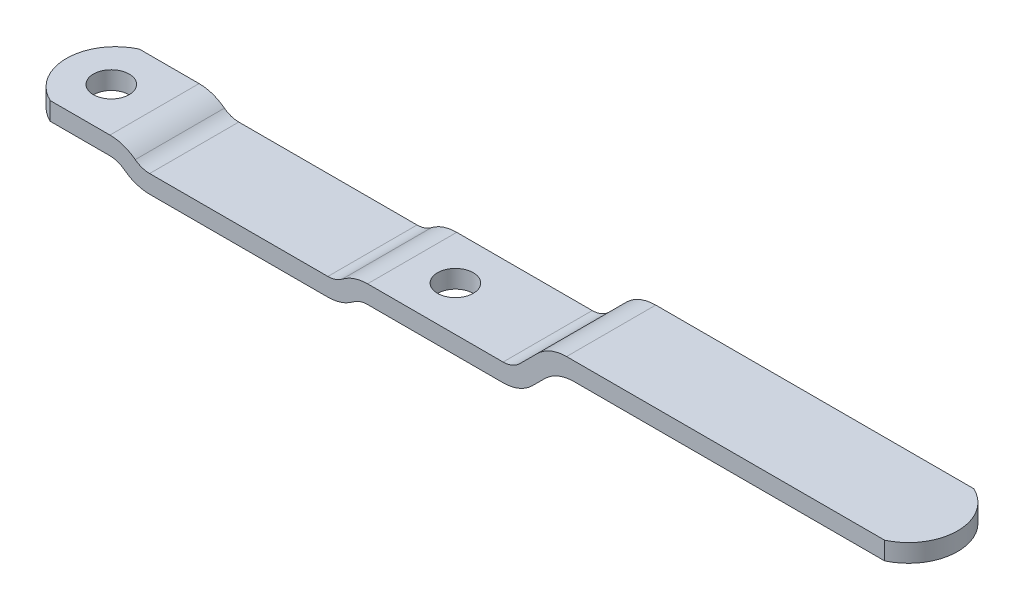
ISO-10303-21;
HEADER;
FILE_DESCRIPTION(('STEP AP214'),'2;1');
FILE_NAME('part.step','',(''),(''),'','','');
FILE_SCHEMA(('AUTOMOTIVE_DESIGN { 1 0 10303 214 1 1 1 1 }'));
ENDSEC;
DATA;
#1=APPLICATION_CONTEXT('core data for automotive mechanical design processes');
#2=APPLICATION_PROTOCOL_DEFINITION('international standard','automotive_design',2000,#1);
#3=PRODUCT_CONTEXT('',#1,'mechanical');
#4=PRODUCT('Part','Part','',(#3));
#5=PRODUCT_RELATED_PRODUCT_CATEGORY('part','',(#4));
#6=PRODUCT_DEFINITION_FORMATION('','',#4);
#7=PRODUCT_DEFINITION_CONTEXT('part definition',#1,'design');
#8=PRODUCT_DEFINITION('design','',#6,#7);
#9=PRODUCT_DEFINITION_SHAPE('','',#8);
#10=(LENGTH_UNIT() NAMED_UNIT(*) SI_UNIT(.MILLI.,.METRE.));
#11=(NAMED_UNIT(*) PLANE_ANGLE_UNIT() SI_UNIT($,.RADIAN.));
#12=(NAMED_UNIT(*) SI_UNIT($,.STERADIAN.) SOLID_ANGLE_UNIT());
#13=UNCERTAINTY_MEASURE_WITH_UNIT(LENGTH_MEASURE(1.E-05),#10,'distance_accuracy_value','');
#14=(GEOMETRIC_REPRESENTATION_CONTEXT(3) GLOBAL_UNCERTAINTY_ASSIGNED_CONTEXT((#13)) GLOBAL_UNIT_ASSIGNED_CONTEXT((#10,
#11,#12)) REPRESENTATION_CONTEXT('',''));
#15=CARTESIAN_POINT('',(0.,0.,0.));
#16=DIRECTION('',(0.,0.,1.));
#17=DIRECTION('',(1.,0.,0.));
#18=AXIS2_PLACEMENT_3D('',#15,#16,#17);
#19=CARTESIAN_POINT('',(265.455705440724,45.4280750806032,7.9375));
#20=DIRECTION('',(0.,-1.,0.));
#21=DIRECTION('',(1.,0.,0.));
#22=AXIS2_PLACEMENT_3D('',#19,#20,#21);
#23=CYLINDRICAL_SURFACE('',#22,3.1875);
#24=CARTESIAN_POINT('',(265.455705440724,205.378428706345,7.9375));
#25=DIRECTION('',(0.,-1.,0.));
#26=DIRECTION('',(1.,0.,0.));
#27=AXIS2_PLACEMENT_3D('',#24,#25,#26);
#28=CIRCLE('',#27,3.1875);
#29=CARTESIAN_POINT('',(268.643205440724,205.378428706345,7.9375));
#30=VERTEX_POINT('',#29);
#31=EDGE_CURVE('E246',#30,#30,#28,.T.);
#32=ORIENTED_EDGE('',*,*,#31,.F.);
#33=EDGE_LOOP('',(#32));
#34=FACE_BOUND('',#33,.T.);
#35=CARTESIAN_POINT('',(265.455705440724,202.178428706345,7.9375));
#36=DIRECTION('',(0.,-1.,0.));
#37=DIRECTION('',(1.,0.,0.));
#38=AXIS2_PLACEMENT_3D('',#35,#36,#37);
#39=CIRCLE('',#38,3.1875);
#40=CARTESIAN_POINT('',(268.643205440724,202.178428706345,7.9375));
#41=VERTEX_POINT('',#40);
#42=EDGE_CURVE('E242',#41,#41,#39,.F.);
#43=ORIENTED_EDGE('',*,*,#42,.F.);
#44=EDGE_LOOP('',(#43));
#45=FACE_BOUND('',#44,.T.);
#46=ADVANCED_FACE('F15',(#34,#45),#23,.F.);
#47=CARTESIAN_POINT('',(326.725705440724,45.4280750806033,7.9375));
#48=DIRECTION('',(0.,-1.,0.));
#49=DIRECTION('',(0.,0.,-1.));
#50=AXIS2_PLACEMENT_3D('',#47,#48,#49);
#51=CYLINDRICAL_SURFACE('',#50,3.1875);
#52=CARTESIAN_POINT('',(326.725705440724,205.378428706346,7.9375));
#53=DIRECTION('',(0.,-1.,0.));
#54=DIRECTION('',(0.,0.,-1.));
#55=AXIS2_PLACEMENT_3D('',#52,#53,#54);
#56=CIRCLE('',#55,3.1875);
#57=CARTESIAN_POINT('',(326.725705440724,205.378428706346,4.75));
#58=VERTEX_POINT('',#57);
#59=EDGE_CURVE('E18',#58,#58,#56,.T.);
#60=ORIENTED_EDGE('',*,*,#59,.F.);
#61=EDGE_LOOP('',(#60));
#62=FACE_BOUND('',#61,.T.);
#63=CARTESIAN_POINT('',(326.725705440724,202.178428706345,7.9375));
#64=DIRECTION('',(0.,-1.,0.));
#65=DIRECTION('',(0.,0.,-1.));
#66=AXIS2_PLACEMENT_3D('',#63,#64,#65);
#67=CIRCLE('',#66,3.1875);
#68=CARTESIAN_POINT('',(326.725705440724,202.178428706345,4.75));
#69=VERTEX_POINT('',#68);
#70=EDGE_CURVE('E237',#69,#69,#67,.F.);
#71=ORIENTED_EDGE('',*,*,#70,.F.);
#72=EDGE_LOOP('',(#71));
#73=FACE_BOUND('',#72,.T.);
#74=ADVANCED_FACE('F283',(#62,#73),#51,.F.);
#75=CARTESIAN_POINT('',(346.125553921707,206.608580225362,0.));
#76=DIRECTION('',(-0.707106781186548,0.707106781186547,0.));
#77=DIRECTION('',(-0.707106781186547,-0.707106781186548,0.));
#78=AXIS2_PLACEMENT_3D('',#75,#76,#77);
#79=PLANE('',#78);
#80=DIRECTION('',(-0.707106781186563,-0.707106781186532,0.));
#81=VECTOR('',#80,1.);
#82=CARTESIAN_POINT('',(349.227992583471,209.711018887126,0.));
#83=LINE('',#82,#81);
#84=CARTESIAN_POINT('',(349.227992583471,209.711018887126,0.));
#85=VERTEX_POINT('',#84);
#86=CARTESIAN_POINT('',(346.125553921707,206.608580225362,0.));
#87=VERTEX_POINT('',#86);
#88=EDGE_CURVE('E233',#85,#87,#83,.T.);
#89=ORIENTED_EDGE('',*,*,#88,.T.);
#90=DIRECTION('',(0.,0.,1.));
#91=VECTOR('',#90,1.);
#92=CARTESIAN_POINT('',(346.125553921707,206.608580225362,0.));
#93=LINE('',#92,#91);
#94=CARTESIAN_POINT('',(346.125553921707,206.608580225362,15.875));
#95=VERTEX_POINT('',#94);
#96=EDGE_CURVE('E272',#95,#87,#93,.F.);
#97=ORIENTED_EDGE('',*,*,#96,.F.);
#98=DIRECTION('',(-0.707106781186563,-0.707106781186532,0.));
#99=VECTOR('',#98,1.);
#100=CARTESIAN_POINT('',(349.227992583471,209.711018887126,15.875));
#101=LINE('',#100,#99);
#102=CARTESIAN_POINT('',(349.227992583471,209.711018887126,15.875));
#103=VERTEX_POINT('',#102);
#104=EDGE_CURVE('E200',#103,#95,#101,.T.);
#105=ORIENTED_EDGE('',*,*,#104,.F.);
#106=DIRECTION('',(0.,0.,1.));
#107=VECTOR('',#106,1.);
#108=CARTESIAN_POINT('',(349.227992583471,209.711018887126,0.));
#109=LINE('',#108,#107);
#110=EDGE_CURVE('E153',#85,#103,#109,.T.);
#111=ORIENTED_EDGE('',*,*,#110,.F.);
#112=EDGE_LOOP('',(#89,#97,#105,#111));
#113=FACE_BOUND('',#112,.T.);
#114=ADVANCED_FACE('F286',(#113),#79,.T.);
#115=CARTESIAN_POINT('',(343.155705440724,209.578428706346,0.));
#116=DIRECTION('',(0.,0.,1.));
#117=DIRECTION('',(1.,0.,0.));
#118=AXIS2_PLACEMENT_3D('',#115,#116,#117);
#119=CYLINDRICAL_SURFACE('',#118,4.19999999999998);
#120=CARTESIAN_POINT('',(343.155705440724,209.578428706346,0.));
#121=DIRECTION('',(0.,0.,1.));
#122=DIRECTION('',(1.,0.,0.));
#123=AXIS2_PLACEMENT_3D('',#120,#121,#122);
#124=CIRCLE('',#123,4.19999999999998);
#125=CARTESIAN_POINT('',(343.155705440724,205.378428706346,0.));
#126=VERTEX_POINT('',#125);
#127=EDGE_CURVE('E231',#87,#126,#124,.F.);
#128=ORIENTED_EDGE('',*,*,#127,.T.);
#129=DIRECTION('',(0.,0.,1.));
#130=VECTOR('',#129,1.);
#131=CARTESIAN_POINT('',(343.155705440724,205.378428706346,0.));
#132=LINE('',#131,#130);
#133=CARTESIAN_POINT('',(343.155705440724,205.378428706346,15.875));
#134=VERTEX_POINT('',#133);
#135=EDGE_CURVE('E270',#134,#126,#132,.F.);
#136=ORIENTED_EDGE('',*,*,#135,.F.);
#137=CARTESIAN_POINT('',(343.155705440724,209.578428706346,15.875));
#138=DIRECTION('',(0.,0.,1.));
#139=DIRECTION('',(1.,0.,0.));
#140=AXIS2_PLACEMENT_3D('',#137,#138,#139);
#141=CIRCLE('',#140,4.19999999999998);
#142=EDGE_CURVE('E197',#95,#134,#141,.F.);
#143=ORIENTED_EDGE('',*,*,#142,.F.);
#144=ORIENTED_EDGE('',*,*,#96,.T.);
#145=EDGE_LOOP('',(#128,#136,#143,#144));
#146=FACE_BOUND('',#145,.T.);
#147=ADVANCED_FACE('F447',(#146),#119,.F.);
#148=CARTESIAN_POINT('',(319.025705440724,205.378428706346,0.));
#149=DIRECTION('',(0.,1.,0.));
#150=DIRECTION('',(0.,0.,1.));
#151=AXIS2_PLACEMENT_3D('',#148,#149,#150);
#152=PLANE('',#151);
#153=DIRECTION('',(1.,0.,0.));
#154=VECTOR('',#153,1.);
#155=CARTESIAN_POINT('',(336.697336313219,205.378428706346,0.));
#156=LINE('',#155,#154);
#157=CARTESIAN_POINT('',(319.025705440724,205.378428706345,0.));
#158=VERTEX_POINT('',#157);
#159=EDGE_CURVE('E230',#126,#158,#156,.F.);
#160=ORIENTED_EDGE('',*,*,#159,.T.);
#161=DIRECTION('',(0.,0.,1.));
#162=VECTOR('',#161,1.);
#163=CARTESIAN_POINT('',(319.025705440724,205.378428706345,0.));
#164=LINE('',#163,#162);
#165=CARTESIAN_POINT('',(319.025705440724,205.378428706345,15.875));
#166=VERTEX_POINT('',#165);
#167=EDGE_CURVE('E267',#166,#158,#164,.F.);
#168=ORIENTED_EDGE('',*,*,#167,.F.);
#169=DIRECTION('',(1.,0.,0.));
#170=VECTOR('',#169,1.);
#171=CARTESIAN_POINT('',(336.697336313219,205.378428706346,15.875));
#172=LINE('',#171,#170);
#173=EDGE_CURVE('E196',#134,#166,#172,.F.);
#174=ORIENTED_EDGE('',*,*,#173,.F.);
#175=ORIENTED_EDGE('',*,*,#135,.T.);
#176=EDGE_LOOP('',(#160,#168,#174,#175));
#177=FACE_BOUND('',#176,.T.);
#178=ORIENTED_EDGE('',*,*,#59,.T.);
#179=EDGE_LOOP('',(#178));
#180=FACE_BOUND('',#179,.T.);
#181=ADVANCED_FACE('F281',(#177,#180),#152,.T.);
#182=CARTESIAN_POINT('',(319.025705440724,197.978428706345,0.));
#183=DIRECTION('',(0.,0.,1.));
#184=DIRECTION('',(1.,0.,0.));
#185=AXIS2_PLACEMENT_3D('',#182,#183,#184);
#186=CYLINDRICAL_SURFACE('',#185,7.4);
#187=CARTESIAN_POINT('',(319.025705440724,197.978428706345,0.));
#188=DIRECTION('',(0.,0.,1.));
#189=DIRECTION('',(1.,0.,0.));
#190=AXIS2_PLACEMENT_3D('',#187,#188,#189);
#191=CIRCLE('',#190,7.4);
#192=CARTESIAN_POINT('',(314.518461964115,203.847394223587,0.));
#193=VERTEX_POINT('',#192);
#194=EDGE_CURVE('E228',#158,#193,#191,.T.);
#195=ORIENTED_EDGE('',*,*,#194,.T.);
#196=DIRECTION('',(0.,0.,1.));
#197=VECTOR('',#196,1.);
#198=CARTESIAN_POINT('',(314.518461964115,203.847394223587,0.));
#199=LINE('',#198,#197);
#200=CARTESIAN_POINT('',(314.518461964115,203.847394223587,15.875));
#201=VERTEX_POINT('',#200);
#202=EDGE_CURVE('E264',#201,#193,#199,.F.);
#203=ORIENTED_EDGE('',*,*,#202,.F.);
#204=CARTESIAN_POINT('',(319.025705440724,197.978428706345,15.875));
#205=DIRECTION('',(0.,0.,1.));
#206=DIRECTION('',(1.,0.,0.));
#207=AXIS2_PLACEMENT_3D('',#204,#205,#206);
#208=CIRCLE('',#207,7.4);
#209=EDGE_CURVE('E193',#166,#201,#208,.T.);
#210=ORIENTED_EDGE('',*,*,#209,.F.);
#211=ORIENTED_EDGE('',*,*,#167,.T.);
#212=EDGE_LOOP('',(#195,#203,#210,#211));
#213=FACE_BOUND('',#212,.T.);
#214=ADVANCED_FACE('F455',(#213),#186,.T.);
#215=CARTESIAN_POINT('',(311.960296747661,207.178428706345,0.));
#216=DIRECTION('',(0.,0.,1.));
#217=DIRECTION('',(1.,0.,0.));
#218=AXIS2_PLACEMENT_3D('',#215,#216,#217);
#219=CYLINDRICAL_SURFACE('',#218,4.19999999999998);
#220=CARTESIAN_POINT('',(311.960296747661,207.178428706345,0.));
#221=DIRECTION('',(0.,0.,1.));
#222=DIRECTION('',(1.,0.,0.));
#223=AXIS2_PLACEMENT_3D('',#220,#221,#222);
#224=CIRCLE('',#223,4.19999999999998);
#225=CARTESIAN_POINT('',(311.960296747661,202.978428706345,0.));
#226=VERTEX_POINT('',#225);
#227=EDGE_CURVE('E226',#193,#226,#224,.F.);
#228=ORIENTED_EDGE('',*,*,#227,.T.);
#229=DIRECTION('',(0.,0.,1.));
#230=VECTOR('',#229,1.);
#231=CARTESIAN_POINT('',(311.960296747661,202.978428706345,0.));
#232=LINE('',#231,#230);
#233=CARTESIAN_POINT('',(311.960296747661,202.978428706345,15.875));
#234=VERTEX_POINT('',#233);
#235=EDGE_CURVE('E258',#234,#226,#232,.F.);
#236=ORIENTED_EDGE('',*,*,#235,.F.);
#237=CARTESIAN_POINT('',(311.960296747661,207.178428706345,15.875));
#238=DIRECTION('',(0.,0.,1.));
#239=DIRECTION('',(1.,0.,0.));
#240=AXIS2_PLACEMENT_3D('',#237,#238,#239);
#241=CIRCLE('',#240,4.19999999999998);
#242=EDGE_CURVE('E190',#201,#234,#241,.F.);
#243=ORIENTED_EDGE('',*,*,#242,.F.);
#244=ORIENTED_EDGE('',*,*,#202,.T.);
#245=EDGE_LOOP('',(#228,#236,#243,#244));
#246=FACE_BOUND('',#245,.T.);
#247=ADVANCED_FACE('F459',(#246),#219,.F.);
#248=CARTESIAN_POINT('',(280.221114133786,202.978428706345,0.));
#249=DIRECTION('',(0.,1.,0.));
#250=DIRECTION('',(0.,0.,1.));
#251=AXIS2_PLACEMENT_3D('',#248,#249,#250);
#252=PLANE('',#251);
#253=DIRECTION('',(1.,0.,0.));
#254=VECTOR('',#253,1.);
#255=CARTESIAN_POINT('',(336.697336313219,202.978428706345,0.));
#256=LINE('',#255,#254);
#257=CARTESIAN_POINT('',(280.221114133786,202.978428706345,0.));
#258=VERTEX_POINT('',#257);
#259=EDGE_CURVE('E225',#226,#258,#256,.F.);
#260=ORIENTED_EDGE('',*,*,#259,.T.);
#261=DIRECTION('',(0.,0.,1.));
#262=VECTOR('',#261,1.);
#263=CARTESIAN_POINT('',(280.221114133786,202.978428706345,0.));
#264=LINE('',#263,#262);
#265=CARTESIAN_POINT('',(280.221114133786,202.978428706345,15.875));
#266=VERTEX_POINT('',#265);
#267=EDGE_CURVE('E252',#266,#258,#264,.F.);
#268=ORIENTED_EDGE('',*,*,#267,.F.);
#269=DIRECTION('',(1.,0.,0.));
#270=VECTOR('',#269,1.);
#271=CARTESIAN_POINT('',(336.697336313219,202.978428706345,15.875));
#272=LINE('',#271,#270);
#273=EDGE_CURVE('E189',#234,#266,#272,.F.);
#274=ORIENTED_EDGE('',*,*,#273,.F.);
#275=ORIENTED_EDGE('',*,*,#235,.T.);
#276=EDGE_LOOP('',(#260,#268,#274,#275));
#277=FACE_BOUND('',#276,.T.);
#278=ADVANCED_FACE('F462',(#277),#252,.T.);
#279=CARTESIAN_POINT('',(280.221114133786,207.178428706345,0.));
#280=DIRECTION('',(0.,0.,1.));
#281=DIRECTION('',(1.,0.,0.));
#282=AXIS2_PLACEMENT_3D('',#279,#280,#281);
#283=CYLINDRICAL_SURFACE('',#282,4.19999999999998);
#284=CARTESIAN_POINT('',(280.221114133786,207.178428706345,0.));
#285=DIRECTION('',(0.,0.,1.));
#286=DIRECTION('',(1.,0.,0.));
#287=AXIS2_PLACEMENT_3D('',#284,#285,#286);
#288=CIRCLE('',#287,4.19999999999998);
#289=CARTESIAN_POINT('',(277.662948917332,203.847394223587,0.));
#290=VERTEX_POINT('',#289);
#291=EDGE_CURVE('E223',#258,#290,#288,.F.);
#292=ORIENTED_EDGE('',*,*,#291,.T.);
#293=DIRECTION('',(0.,0.,1.));
#294=VECTOR('',#293,1.);
#295=CARTESIAN_POINT('',(277.662948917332,203.847394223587,0.));
#296=LINE('',#295,#294);
#297=CARTESIAN_POINT('',(277.662948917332,203.847394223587,15.875));
#298=VERTEX_POINT('',#297);
#299=EDGE_CURVE('E248',#298,#290,#296,.F.);
#300=ORIENTED_EDGE('',*,*,#299,.F.);
#301=CARTESIAN_POINT('',(280.221114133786,207.178428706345,15.875));
#302=DIRECTION('',(0.,0.,1.));
#303=DIRECTION('',(1.,0.,0.));
#304=AXIS2_PLACEMENT_3D('',#301,#302,#303);
#305=CIRCLE('',#304,4.19999999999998);
#306=EDGE_CURVE('E186',#266,#298,#305,.F.);
#307=ORIENTED_EDGE('',*,*,#306,.F.);
#308=ORIENTED_EDGE('',*,*,#267,.T.);
#309=EDGE_LOOP('',(#292,#300,#307,#308));
#310=FACE_BOUND('',#309,.T.);
#311=ADVANCED_FACE('F466',(#310),#283,.F.);
#312=CARTESIAN_POINT('',(273.155705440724,197.978428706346,0.));
#313=DIRECTION('',(0.,0.,1.));
#314=DIRECTION('',(1.,0.,0.));
#315=AXIS2_PLACEMENT_3D('',#312,#313,#314);
#316=CYLINDRICAL_SURFACE('',#315,7.4);
#317=CARTESIAN_POINT('',(273.155705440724,197.978428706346,0.));
#318=DIRECTION('',(0.,0.,1.));
#319=DIRECTION('',(1.,0.,0.));
#320=AXIS2_PLACEMENT_3D('',#317,#318,#319);
#321=CIRCLE('',#320,7.4);
#322=CARTESIAN_POINT('',(273.155705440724,205.378428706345,0.));
#323=VERTEX_POINT('',#322);
#324=EDGE_CURVE('E133',#290,#323,#321,.T.);
#325=ORIENTED_EDGE('',*,*,#324,.T.);
#326=DIRECTION('',(0.,0.,1.));
#327=VECTOR('',#326,1.);
#328=CARTESIAN_POINT('',(273.155705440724,205.378428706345,0.));
#329=LINE('',#328,#327);
#330=CARTESIAN_POINT('',(273.155705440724,205.378428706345,15.875));
#331=VERTEX_POINT('',#330);
#332=EDGE_CURVE('E128',#331,#323,#329,.F.);
#333=ORIENTED_EDGE('',*,*,#332,.F.);
#334=CARTESIAN_POINT('',(273.155705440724,197.978428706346,15.875));
#335=DIRECTION('',(0.,0.,1.));
#336=DIRECTION('',(1.,0.,0.));
#337=AXIS2_PLACEMENT_3D('',#334,#335,#336);
#338=CIRCLE('',#337,7.4);
#339=EDGE_CURVE('E182',#298,#331,#338,.T.);
#340=ORIENTED_EDGE('',*,*,#339,.F.);
#341=ORIENTED_EDGE('',*,*,#299,.T.);
#342=EDGE_LOOP('',(#325,#333,#340,#341));
#343=FACE_BOUND('',#342,.T.);
#344=ADVANCED_FACE('F467',(#343),#316,.T.);
#345=CARTESIAN_POINT('',(257.455705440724,205.378428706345,0.));
#346=DIRECTION('',(0.,1.,0.));
#347=DIRECTION('',(0.,0.,1.));
#348=AXIS2_PLACEMENT_3D('',#345,#346,#347);
#349=PLANE('',#348);
#350=ORIENTED_EDGE('',*,*,#332,.T.);
#351=DIRECTION('',(1.,0.,0.));
#352=VECTOR('',#351,1.);
#353=CARTESIAN_POINT('',(336.697336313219,205.378428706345,0.));
#354=LINE('',#353,#352);
#355=CARTESIAN_POINT('',(262.52350586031,205.378428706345,0.));
#356=VERTEX_POINT('',#355);
#357=EDGE_CURVE('E120',#323,#356,#354,.F.);
#358=ORIENTED_EDGE('',*,*,#357,.T.);
#359=CARTESIAN_POINT('',(266.205705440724,205.378428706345,7.93749999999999));
#360=DIRECTION('',(0.,-1.,0.));
#361=DIRECTION('',(0.,0.,-1.));
#362=AXIS2_PLACEMENT_3D('',#359,#360,#361);
#363=CIRCLE('',#362,8.74999999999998);
#364=CARTESIAN_POINT('',(262.52350586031,205.378428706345,15.875));
#365=VERTEX_POINT('',#364);
#366=EDGE_CURVE('E125',#356,#365,#363,.F.);
#367=ORIENTED_EDGE('',*,*,#366,.T.);
#368=DIRECTION('',(1.,0.,0.));
#369=VECTOR('',#368,1.);
#370=CARTESIAN_POINT('',(336.697336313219,205.378428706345,15.875));
#371=LINE('',#370,#369);
#372=EDGE_CURVE('E185',#331,#365,#371,.F.);
#373=ORIENTED_EDGE('',*,*,#372,.F.);
#374=EDGE_LOOP('',(#350,#358,#367,#373));
#375=FACE_BOUND('',#374,.T.);
#376=ORIENTED_EDGE('',*,*,#31,.T.);
#377=EDGE_LOOP('',(#376));
#378=FACE_BOUND('',#377,.T.);
#379=ADVANCED_FACE('F122',(#375,#378),#349,.T.);
#380=CARTESIAN_POINT('',(266.205705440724,205.378428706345,7.93749999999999));
#381=DIRECTION('',(0.,-1.,0.));
#382=DIRECTION('',(0.,0.,-1.));
#383=AXIS2_PLACEMENT_3D('',#380,#381,#382);
#384=CYLINDRICAL_SURFACE('',#383,8.74999999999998);
#385=DIRECTION('',(0.,1.,0.));
#386=VECTOR('',#385,1.);
#387=CARTESIAN_POINT('',(262.52350586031,205.959986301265,15.875));
#388=LINE('',#387,#386);
#389=CARTESIAN_POINT('',(262.52350586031,202.178428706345,15.875));
#390=VERTEX_POINT('',#389);
#391=EDGE_CURVE('E139',#365,#390,#388,.F.);
#392=ORIENTED_EDGE('',*,*,#391,.F.);
#393=ORIENTED_EDGE('',*,*,#366,.F.);
#394=DIRECTION('',(0.,1.,0.));
#395=VECTOR('',#394,1.);
#396=CARTESIAN_POINT('',(262.52350586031,205.959986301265,0.));
#397=LINE('',#396,#395);
#398=CARTESIAN_POINT('',(262.52350586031,202.178428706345,0.));
#399=VERTEX_POINT('',#398);
#400=EDGE_CURVE('E132',#356,#399,#397,.F.);
#401=ORIENTED_EDGE('',*,*,#400,.T.);
#402=CARTESIAN_POINT('',(266.205705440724,202.178428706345,7.93749999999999));
#403=DIRECTION('',(0.,-1.,0.));
#404=DIRECTION('',(0.,0.,-1.));
#405=AXIS2_PLACEMENT_3D('',#402,#403,#404);
#406=CIRCLE('',#405,8.74999999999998);
#407=EDGE_CURVE('E141',#390,#399,#406,.T.);
#408=ORIENTED_EDGE('',*,*,#407,.F.);
#409=EDGE_LOOP('',(#392,#393,#401,#408));
#410=FACE_BOUND('',#409,.T.);
#411=ADVANCED_FACE('F136',(#410),#384,.T.);
#412=CARTESIAN_POINT('',(273.155705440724,202.178428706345,0.));
#413=DIRECTION('',(0.,-1.,0.));
#414=DIRECTION('',(0.,0.,-1.));
#415=AXIS2_PLACEMENT_3D('',#412,#413,#414);
#416=PLANE('',#415);
#417=ORIENTED_EDGE('',*,*,#42,.T.);
#418=EDGE_LOOP('',(#417));
#419=FACE_BOUND('',#418,.T.);
#420=DIRECTION('',(0.,0.,1.));
#421=VECTOR('',#420,1.);
#422=CARTESIAN_POINT('',(273.155705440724,202.178428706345,0.));
#423=LINE('',#422,#421);
#424=CARTESIAN_POINT('',(273.155705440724,202.178428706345,15.875));
#425=VERTEX_POINT('',#424);
#426=CARTESIAN_POINT('',(273.155705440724,202.178428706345,0.));
#427=VERTEX_POINT('',#426);
#428=EDGE_CURVE('E245',#425,#427,#423,.F.);
#429=ORIENTED_EDGE('',*,*,#428,.F.);
#430=DIRECTION('',(1.,0.,0.));
#431=VECTOR('',#430,1.);
#432=CARTESIAN_POINT('',(336.697336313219,202.178428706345,15.875));
#433=LINE('',#432,#431);
#434=EDGE_CURVE('E181',#390,#425,#433,.T.);
#435=ORIENTED_EDGE('',*,*,#434,.F.);
#436=ORIENTED_EDGE('',*,*,#407,.T.);
#437=DIRECTION('',(1.,0.,0.));
#438=VECTOR('',#437,1.);
#439=CARTESIAN_POINT('',(336.697336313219,202.178428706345,0.));
#440=LINE('',#439,#438);
#441=EDGE_CURVE('E147',#399,#427,#440,.T.);
#442=ORIENTED_EDGE('',*,*,#441,.T.);
#443=EDGE_LOOP('',(#429,#435,#436,#442));
#444=FACE_BOUND('',#443,.T.);
#445=ADVANCED_FACE('F542',(#419,#444),#416,.T.);
#446=CARTESIAN_POINT('',(273.155705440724,197.978428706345,0.));
#447=DIRECTION('',(0.,0.,1.));
#448=DIRECTION('',(1.,0.,0.));
#449=AXIS2_PLACEMENT_3D('',#446,#447,#448);
#450=CYLINDRICAL_SURFACE('',#449,4.19999999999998);
#451=CARTESIAN_POINT('',(273.155705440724,197.978428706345,0.));
#452=DIRECTION('',(0.,0.,1.));
#453=DIRECTION('',(1.,0.,0.));
#454=AXIS2_PLACEMENT_3D('',#451,#452,#453);
#455=CIRCLE('',#454,4.19999999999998);
#456=CARTESIAN_POINT('',(275.713870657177,201.309463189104,0.));
#457=VERTEX_POINT('',#456);
#458=EDGE_CURVE('E149',#427,#457,#455,.F.);
#459=ORIENTED_EDGE('',*,*,#458,.T.);
#460=DIRECTION('',(0.,0.,1.));
#461=VECTOR('',#460,1.);
#462=CARTESIAN_POINT('',(275.713870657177,201.309463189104,0.));
#463=LINE('',#462,#461);
#464=CARTESIAN_POINT('',(275.713870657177,201.309463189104,15.875));
#465=VERTEX_POINT('',#464);
#466=EDGE_CURVE('E385',#465,#457,#463,.F.);
#467=ORIENTED_EDGE('',*,*,#466,.F.);
#468=CARTESIAN_POINT('',(273.155705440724,197.978428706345,15.875));
#469=DIRECTION('',(0.,0.,1.));
#470=DIRECTION('',(1.,0.,0.));
#471=AXIS2_PLACEMENT_3D('',#468,#469,#470);
#472=CIRCLE('',#471,4.19999999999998);
#473=EDGE_CURVE('E178',#425,#465,#472,.F.);
#474=ORIENTED_EDGE('',*,*,#473,.F.);
#475=ORIENTED_EDGE('',*,*,#428,.T.);
#476=EDGE_LOOP('',(#459,#467,#474,#475));
#477=FACE_BOUND('',#476,.T.);
#478=ADVANCED_FACE('F550',(#477),#450,.F.);
#479=CARTESIAN_POINT('',(280.221114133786,207.178428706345,0.));
#480=DIRECTION('',(0.,0.,1.));
#481=DIRECTION('',(1.,0.,0.));
#482=AXIS2_PLACEMENT_3D('',#479,#480,#481);
#483=CYLINDRICAL_SURFACE('',#482,7.4);
#484=CARTESIAN_POINT('',(280.221114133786,207.178428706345,0.));
#485=DIRECTION('',(0.,0.,1.));
#486=DIRECTION('',(1.,0.,0.));
#487=AXIS2_PLACEMENT_3D('',#484,#485,#486);
#488=CIRCLE('',#487,7.4);
#489=CARTESIAN_POINT('',(280.221114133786,199.778428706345,0.));
#490=VERTEX_POINT('',#489);
#491=EDGE_CURVE('E219',#457,#490,#488,.T.);
#492=ORIENTED_EDGE('',*,*,#491,.T.);
#493=DIRECTION('',(0.,0.,-1.));
#494=VECTOR('',#493,1.);
#495=CARTESIAN_POINT('',(280.221114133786,199.778428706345,0.));
#496=LINE('',#495,#494);
#497=CARTESIAN_POINT('',(280.221114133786,199.778428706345,15.875));
#498=VERTEX_POINT('',#497);
#499=EDGE_CURVE('E382',#498,#490,#496,.T.);
#500=ORIENTED_EDGE('',*,*,#499,.F.);
#501=CARTESIAN_POINT('',(280.221114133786,207.178428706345,15.875));
#502=DIRECTION('',(0.,0.,1.));
#503=DIRECTION('',(1.,0.,0.));
#504=AXIS2_PLACEMENT_3D('',#501,#502,#503);
#505=CIRCLE('',#504,7.4);
#506=EDGE_CURVE('E175',#465,#498,#505,.T.);
#507=ORIENTED_EDGE('',*,*,#506,.F.);
#508=ORIENTED_EDGE('',*,*,#466,.T.);
#509=EDGE_LOOP('',(#492,#500,#507,#508));
#510=FACE_BOUND('',#509,.T.);
#511=ADVANCED_FACE('F560',(#510),#483,.T.);
#512=CARTESIAN_POINT('',(311.960296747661,199.778428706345,0.));
#513=DIRECTION('',(0.,-1.,0.));
#514=DIRECTION('',(0.,0.,-1.));
#515=AXIS2_PLACEMENT_3D('',#512,#513,#514);
#516=PLANE('',#515);
#517=DIRECTION('',(1.,0.,0.));
#518=VECTOR('',#517,1.);
#519=CARTESIAN_POINT('',(336.697336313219,199.778428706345,0.));
#520=LINE('',#519,#518);
#521=CARTESIAN_POINT('',(311.960296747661,199.778428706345,0.));
#522=VERTEX_POINT('',#521);
#523=EDGE_CURVE('E218',#490,#522,#520,.T.);
#524=ORIENTED_EDGE('',*,*,#523,.T.);
#525=DIRECTION('',(0.,0.,1.));
#526=VECTOR('',#525,1.);
#527=CARTESIAN_POINT('',(311.960296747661,199.778428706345,0.));
#528=LINE('',#527,#526);
#529=CARTESIAN_POINT('',(311.960296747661,199.778428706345,15.875));
#530=VERTEX_POINT('',#529);
#531=EDGE_CURVE('E379',#530,#522,#528,.F.);
#532=ORIENTED_EDGE('',*,*,#531,.F.);
#533=DIRECTION('',(1.,0.,0.));
#534=VECTOR('',#533,1.);
#535=CARTESIAN_POINT('',(336.697336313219,199.778428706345,15.875));
#536=LINE('',#535,#534);
#537=EDGE_CURVE('E174',#498,#530,#536,.T.);
#538=ORIENTED_EDGE('',*,*,#537,.F.);
#539=ORIENTED_EDGE('',*,*,#499,.T.);
#540=EDGE_LOOP('',(#524,#532,#538,#539));
#541=FACE_BOUND('',#540,.T.);
#542=ADVANCED_FACE('F416',(#541),#516,.T.);
#543=CARTESIAN_POINT('',(311.960296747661,207.178428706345,0.));
#544=DIRECTION('',(0.,0.,1.));
#545=DIRECTION('',(1.,0.,0.));
#546=AXIS2_PLACEMENT_3D('',#543,#544,#545);
#547=CYLINDRICAL_SURFACE('',#546,7.4);
#548=CARTESIAN_POINT('',(311.960296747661,207.178428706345,0.));
#549=DIRECTION('',(0.,0.,1.));
#550=DIRECTION('',(1.,0.,0.));
#551=AXIS2_PLACEMENT_3D('',#548,#549,#550);
#552=CIRCLE('',#551,7.4);
#553=CARTESIAN_POINT('',(316.46754022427,201.309463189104,0.));
#554=VERTEX_POINT('',#553);
#555=EDGE_CURVE('E216',#522,#554,#552,.T.);
#556=ORIENTED_EDGE('',*,*,#555,.T.);
#557=DIRECTION('',(0.,0.,1.));
#558=VECTOR('',#557,1.);
#559=CARTESIAN_POINT('',(316.46754022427,201.309463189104,0.));
#560=LINE('',#559,#558);
#561=CARTESIAN_POINT('',(316.46754022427,201.309463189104,15.875));
#562=VERTEX_POINT('',#561);
#563=EDGE_CURVE('E241',#562,#554,#560,.F.);
#564=ORIENTED_EDGE('',*,*,#563,.F.);
#565=CARTESIAN_POINT('',(311.960296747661,207.178428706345,15.875));
#566=DIRECTION('',(0.,0.,1.));
#567=DIRECTION('',(1.,0.,0.));
#568=AXIS2_PLACEMENT_3D('',#565,#566,#567);
#569=CIRCLE('',#568,7.4);
#570=EDGE_CURVE('E171',#530,#562,#569,.T.);
#571=ORIENTED_EDGE('',*,*,#570,.F.);
#572=ORIENTED_EDGE('',*,*,#531,.T.);
#573=EDGE_LOOP('',(#556,#564,#571,#572));
#574=FACE_BOUND('',#573,.T.);
#575=ADVANCED_FACE('F303',(#574),#547,.T.);
#576=CARTESIAN_POINT('',(319.025705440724,197.978428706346,0.));
#577=DIRECTION('',(0.,0.,1.));
#578=DIRECTION('',(1.,0.,0.));
#579=AXIS2_PLACEMENT_3D('',#576,#577,#578);
#580=CYLINDRICAL_SURFACE('',#579,4.19999999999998);
#581=CARTESIAN_POINT('',(319.025705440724,197.978428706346,0.));
#582=DIRECTION('',(0.,0.,1.));
#583=DIRECTION('',(1.,0.,0.));
#584=AXIS2_PLACEMENT_3D('',#581,#582,#583);
#585=CIRCLE('',#584,4.19999999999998);
#586=CARTESIAN_POINT('',(319.025705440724,202.178428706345,0.));
#587=VERTEX_POINT('',#586);
#588=EDGE_CURVE('E214',#554,#587,#585,.F.);
#589=ORIENTED_EDGE('',*,*,#588,.T.);
#590=DIRECTION('',(0.,0.,-1.));
#591=VECTOR('',#590,1.);
#592=CARTESIAN_POINT('',(319.025705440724,202.178428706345,0.));
#593=LINE('',#592,#591);
#594=CARTESIAN_POINT('',(319.025705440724,202.178428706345,15.875));
#595=VERTEX_POINT('',#594);
#596=EDGE_CURVE('E240',#595,#587,#593,.T.);
#597=ORIENTED_EDGE('',*,*,#596,.F.);
#598=CARTESIAN_POINT('',(319.025705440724,197.978428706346,15.875));
#599=DIRECTION('',(0.,0.,1.));
#600=DIRECTION('',(1.,0.,0.));
#601=AXIS2_PLACEMENT_3D('',#598,#599,#600);
#602=CIRCLE('',#601,4.19999999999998);
#603=EDGE_CURVE('E168',#562,#595,#602,.F.);
#604=ORIENTED_EDGE('',*,*,#603,.F.);
#605=ORIENTED_EDGE('',*,*,#563,.T.);
#606=EDGE_LOOP('',(#589,#597,#604,#605));
#607=FACE_BOUND('',#606,.T.);
#608=ADVANCED_FACE('F292',(#607),#580,.F.);
#609=CARTESIAN_POINT('',(343.155705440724,202.178428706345,0.));
#610=DIRECTION('',(0.,-1.,0.));
#611=DIRECTION('',(0.,0.,-1.));
#612=AXIS2_PLACEMENT_3D('',#609,#610,#611);
#613=PLANE('',#612);
#614=DIRECTION('',(1.,0.,0.));
#615=VECTOR('',#614,1.);
#616=CARTESIAN_POINT('',(336.697336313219,202.178428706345,0.));
#617=LINE('',#616,#615);
#618=CARTESIAN_POINT('',(343.155705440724,202.178428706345,0.));
#619=VERTEX_POINT('',#618);
#620=EDGE_CURVE('E213',#587,#619,#617,.T.);
#621=ORIENTED_EDGE('',*,*,#620,.T.);
#622=DIRECTION('',(0.,0.,1.));
#623=VECTOR('',#622,1.);
#624=CARTESIAN_POINT('',(343.155705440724,202.178428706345,0.));
#625=LINE('',#624,#623);
#626=CARTESIAN_POINT('',(343.155705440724,202.178428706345,15.875));
#627=VERTEX_POINT('',#626);
#628=EDGE_CURVE('E372',#627,#619,#625,.F.);
#629=ORIENTED_EDGE('',*,*,#628,.F.);
#630=DIRECTION('',(1.,0.,0.));
#631=VECTOR('',#630,1.);
#632=CARTESIAN_POINT('',(336.697336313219,202.178428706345,15.875));
#633=LINE('',#632,#631);
#634=EDGE_CURVE('E167',#595,#627,#633,.T.);
#635=ORIENTED_EDGE('',*,*,#634,.F.);
#636=ORIENTED_EDGE('',*,*,#596,.T.);
#637=EDGE_LOOP('',(#621,#629,#635,#636));
#638=FACE_BOUND('',#637,.T.);
#639=ORIENTED_EDGE('',*,*,#70,.T.);
#640=EDGE_LOOP('',(#639));
#641=FACE_BOUND('',#640,.T.);
#642=ADVANCED_FACE('F289',(#638,#641),#613,.T.);
#643=CARTESIAN_POINT('',(343.155705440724,209.578428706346,0.));
#644=DIRECTION('',(0.,0.,1.));
#645=DIRECTION('',(1.,0.,0.));
#646=AXIS2_PLACEMENT_3D('',#643,#644,#645);
#647=CYLINDRICAL_SURFACE('',#646,7.4);
#648=CARTESIAN_POINT('',(343.155705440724,209.578428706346,0.));
#649=DIRECTION('',(0.,0.,1.));
#650=DIRECTION('',(1.,0.,0.));
#651=AXIS2_PLACEMENT_3D('',#648,#649,#650);
#652=CIRCLE('',#651,7.4);
#653=CARTESIAN_POINT('',(348.388295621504,204.345838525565,0.));
#654=VERTEX_POINT('',#653);
#655=EDGE_CURVE('E211',#619,#654,#652,.T.);
#656=ORIENTED_EDGE('',*,*,#655,.T.);
#657=DIRECTION('',(0.,0.,1.));
#658=VECTOR('',#657,1.);
#659=CARTESIAN_POINT('',(348.388295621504,204.345838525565,0.));
#660=LINE('',#659,#658);
#661=CARTESIAN_POINT('',(348.388295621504,204.345838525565,15.875));
#662=VERTEX_POINT('',#661);
#663=EDGE_CURVE('E348',#662,#654,#660,.F.);
#664=ORIENTED_EDGE('',*,*,#663,.F.);
#665=CARTESIAN_POINT('',(343.155705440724,209.578428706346,15.875));
#666=DIRECTION('',(0.,0.,1.));
#667=DIRECTION('',(1.,0.,0.));
#668=AXIS2_PLACEMENT_3D('',#665,#666,#667);
#669=CIRCLE('',#668,7.4);
#670=EDGE_CURVE('E164',#627,#662,#669,.T.);
#671=ORIENTED_EDGE('',*,*,#670,.F.);
#672=ORIENTED_EDGE('',*,*,#628,.T.);
#673=EDGE_LOOP('',(#656,#664,#671,#672));
#674=FACE_BOUND('',#673,.T.);
#675=ADVANCED_FACE('F291',(#674),#647,.T.);
#676=CARTESIAN_POINT('',(350.553475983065,206.511018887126,0.));
#677=DIRECTION('',(0.707106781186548,-0.707106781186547,0.));
#678=DIRECTION('',(0.707106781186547,0.707106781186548,0.));
#679=AXIS2_PLACEMENT_3D('',#676,#677,#678);
#680=PLANE('',#679);
#681=DIRECTION('',(0.707106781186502,0.707106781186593,0.));
#682=VECTOR('',#681,1.);
#683=CARTESIAN_POINT('',(348.388295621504,204.345838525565,0.));
#684=LINE('',#683,#682);
#685=CARTESIAN_POINT('',(350.553475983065,206.511018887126,0.));
#686=VERTEX_POINT('',#685);
#687=EDGE_CURVE('E210',#654,#686,#684,.T.);
#688=ORIENTED_EDGE('',*,*,#687,.T.);
#689=DIRECTION('',(0.,0.,1.));
#690=VECTOR('',#689,1.);
#691=CARTESIAN_POINT('',(350.553475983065,206.511018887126,0.));
#692=LINE('',#691,#690);
#693=CARTESIAN_POINT('',(350.553475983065,206.511018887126,15.875));
#694=VERTEX_POINT('',#693);
#695=EDGE_CURVE('E345',#694,#686,#692,.F.);
#696=ORIENTED_EDGE('',*,*,#695,.F.);
#697=DIRECTION('',(0.707106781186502,0.707106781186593,0.));
#698=VECTOR('',#697,1.);
#699=CARTESIAN_POINT('',(348.388295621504,204.345838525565,15.875));
#700=LINE('',#699,#698);
#701=EDGE_CURVE('E163',#662,#694,#700,.T.);
#702=ORIENTED_EDGE('',*,*,#701,.F.);
#703=ORIENTED_EDGE('',*,*,#663,.T.);
#704=EDGE_LOOP('',(#688,#696,#702,#703));
#705=FACE_BOUND('',#704,.T.);
#706=ADVANCED_FACE('F300',(#705),#680,.T.);
#707=CARTESIAN_POINT('',(355.786066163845,201.278428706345,0.));
#708=DIRECTION('',(0.,0.,1.));
#709=DIRECTION('',(1.,0.,0.));
#710=AXIS2_PLACEMENT_3D('',#707,#708,#709);
#711=CYLINDRICAL_SURFACE('',#710,7.40000000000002);
#712=CARTESIAN_POINT('',(355.786066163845,201.278428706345,0.));
#713=DIRECTION('',(0.,0.,1.));
#714=DIRECTION('',(1.,0.,0.));
#715=AXIS2_PLACEMENT_3D('',#712,#713,#714);
#716=CIRCLE('',#715,7.40000000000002);
#717=CARTESIAN_POINT('',(355.786066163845,208.678428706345,0.));
#718=VERTEX_POINT('',#717);
#719=EDGE_CURVE('E207',#686,#718,#716,.F.);
#720=ORIENTED_EDGE('',*,*,#719,.T.);
#721=DIRECTION('',(0.,0.,-1.));
#722=VECTOR('',#721,1.);
#723=CARTESIAN_POINT('',(355.786066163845,208.678428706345,0.));
#724=LINE('',#723,#722);
#725=CARTESIAN_POINT('',(355.786066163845,208.678428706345,15.875));
#726=VERTEX_POINT('',#725);
#727=EDGE_CURVE('E236',#726,#718,#724,.T.);
#728=ORIENTED_EDGE('',*,*,#727,.F.);
#729=CARTESIAN_POINT('',(355.786066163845,201.278428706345,15.875));
#730=DIRECTION('',(0.,0.,1.));
#731=DIRECTION('',(1.,0.,0.));
#732=AXIS2_PLACEMENT_3D('',#729,#730,#731);
#733=CIRCLE('',#732,7.40000000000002);
#734=EDGE_CURVE('E160',#694,#726,#733,.F.);
#735=ORIENTED_EDGE('',*,*,#734,.F.);
#736=ORIENTED_EDGE('',*,*,#695,.T.);
#737=EDGE_LOOP('',(#720,#728,#735,#736));
#738=FACE_BOUND('',#737,.T.);
#739=ADVANCED_FACE('F330',(#738),#711,.F.);
#740=CARTESIAN_POINT('',(416.155705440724,208.678428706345,0.));
#741=DIRECTION('',(0.,-1.,0.));
#742=DIRECTION('',(0.,0.,-1.));
#743=AXIS2_PLACEMENT_3D('',#740,#741,#742);
#744=PLANE('',#743);
#745=ORIENTED_EDGE('',*,*,#727,.T.);
#746=DIRECTION('',(1.,0.,0.));
#747=VECTOR('',#746,1.);
#748=CARTESIAN_POINT('',(336.697336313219,208.678428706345,0.));
#749=LINE('',#748,#747);
#750=CARTESIAN_POINT('',(411.087905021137,208.678428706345,0.));
#751=VERTEX_POINT('',#750);
#752=EDGE_CURVE('E209',#718,#751,#749,.T.);
#753=ORIENTED_EDGE('',*,*,#752,.T.);
#754=CARTESIAN_POINT('',(407.405705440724,208.678428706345,7.9375));
#755=DIRECTION('',(0.,1.,0.));
#756=DIRECTION('',(0.,0.,1.));
#757=AXIS2_PLACEMENT_3D('',#754,#755,#756);
#758=CIRCLE('',#757,8.74999999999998);
#759=CARTESIAN_POINT('',(411.087905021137,208.678428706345,15.875));
#760=VERTEX_POINT('',#759);
#761=EDGE_CURVE('E234',#751,#760,#758,.F.);
#762=ORIENTED_EDGE('',*,*,#761,.T.);
#763=DIRECTION('',(1.,0.,0.));
#764=VECTOR('',#763,1.);
#765=CARTESIAN_POINT('',(336.697336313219,208.678428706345,15.875));
#766=LINE('',#765,#764);
#767=EDGE_CURVE('E159',#726,#760,#766,.T.);
#768=ORIENTED_EDGE('',*,*,#767,.F.);
#769=EDGE_LOOP('',(#745,#753,#762,#768));
#770=FACE_BOUND('',#769,.T.);
#771=ADVANCED_FACE('F326',(#770),#744,.T.);
#772=CARTESIAN_POINT('',(407.405705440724,208.678428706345,7.9375));
#773=DIRECTION('',(0.,1.,0.));
#774=DIRECTION('',(0.,0.,1.));
#775=AXIS2_PLACEMENT_3D('',#772,#773,#774);
#776=CYLINDRICAL_SURFACE('',#775,8.74999999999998);
#777=ORIENTED_EDGE('',*,*,#761,.F.);
#778=DIRECTION('',(0.,1.,0.));
#779=VECTOR('',#778,1.);
#780=CARTESIAN_POINT('',(411.087905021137,205.959986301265,0.));
#781=LINE('',#780,#779);
#782=CARTESIAN_POINT('',(411.087905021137,211.878428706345,0.));
#783=VERTEX_POINT('',#782);
#784=EDGE_CURVE('E206',#751,#783,#781,.T.);
#785=ORIENTED_EDGE('',*,*,#784,.T.);
#786=CARTESIAN_POINT('',(407.405705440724,211.878428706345,7.9375));
#787=DIRECTION('',(0.,1.,0.));
#788=DIRECTION('',(0.,0.,1.));
#789=AXIS2_PLACEMENT_3D('',#786,#787,#788);
#790=CIRCLE('',#789,8.74999999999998);
#791=CARTESIAN_POINT('',(411.087905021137,211.878428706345,15.875));
#792=VERTEX_POINT('',#791);
#793=EDGE_CURVE('E155',#792,#783,#790,.T.);
#794=ORIENTED_EDGE('',*,*,#793,.F.);
#795=DIRECTION('',(0.,1.,0.));
#796=VECTOR('',#795,1.);
#797=CARTESIAN_POINT('',(411.087905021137,205.959986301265,15.875));
#798=LINE('',#797,#796);
#799=EDGE_CURVE('E202',#760,#792,#798,.T.);
#800=ORIENTED_EDGE('',*,*,#799,.F.);
#801=EDGE_LOOP('',(#777,#785,#794,#800));
#802=FACE_BOUND('',#801,.T.);
#803=ADVANCED_FACE('F323',(#802),#776,.T.);
#804=CARTESIAN_POINT('',(336.697336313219,205.959986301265,0.));
#805=DIRECTION('',(0.,0.,1.));
#806=DIRECTION('',(1.,0.,0.));
#807=AXIS2_PLACEMENT_3D('',#804,#805,#806);
#808=PLANE('',#807);
#809=ORIENTED_EDGE('',*,*,#752,.F.);
#810=ORIENTED_EDGE('',*,*,#719,.F.);
#811=ORIENTED_EDGE('',*,*,#687,.F.);
#812=ORIENTED_EDGE('',*,*,#655,.F.);
#813=ORIENTED_EDGE('',*,*,#620,.F.);
#814=ORIENTED_EDGE('',*,*,#588,.F.);
#815=ORIENTED_EDGE('',*,*,#555,.F.);
#816=ORIENTED_EDGE('',*,*,#523,.F.);
#817=ORIENTED_EDGE('',*,*,#491,.F.);
#818=ORIENTED_EDGE('',*,*,#458,.F.);
#819=ORIENTED_EDGE('',*,*,#441,.F.);
#820=ORIENTED_EDGE('',*,*,#400,.F.);
#821=ORIENTED_EDGE('',*,*,#357,.F.);
#822=ORIENTED_EDGE('',*,*,#324,.F.);
#823=ORIENTED_EDGE('',*,*,#291,.F.);
#824=ORIENTED_EDGE('',*,*,#259,.F.);
#825=ORIENTED_EDGE('',*,*,#227,.F.);
#826=ORIENTED_EDGE('',*,*,#194,.F.);
#827=ORIENTED_EDGE('',*,*,#159,.F.);
#828=ORIENTED_EDGE('',*,*,#127,.F.);
#829=ORIENTED_EDGE('',*,*,#88,.F.);
#830=CARTESIAN_POINT('',(354.460582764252,204.478428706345,0.));
#831=DIRECTION('',(0.,0.,1.));
#832=DIRECTION('',(1.,0.,0.));
#833=AXIS2_PLACEMENT_3D('',#830,#831,#832);
#834=CIRCLE('',#833,7.4);
#835=CARTESIAN_POINT('',(354.460582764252,211.878428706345,0.));
#836=VERTEX_POINT('',#835);
#837=EDGE_CURVE('E203',#836,#85,#834,.T.);
#838=ORIENTED_EDGE('',*,*,#837,.F.);
#839=DIRECTION('',(1.,0.,0.));
#840=VECTOR('',#839,1.);
#841=CARTESIAN_POINT('',(354.460582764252,211.878428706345,0.));
#842=LINE('',#841,#840);
#843=EDGE_CURVE('E158',#783,#836,#842,.F.);
#844=ORIENTED_EDGE('',*,*,#843,.F.);
#845=ORIENTED_EDGE('',*,*,#784,.F.);
#846=EDGE_LOOP('',(#809,#810,#811,#812,#813,#814,#815,#816,#817,#818,#819,#820,#821,#822,#823,
#824,#825,#826,#827,#828,#829,#838,#844,#845));
#847=FACE_BOUND('',#846,.T.);
#848=ADVANCED_FACE('F145',(#847),#808,.F.);
#849=CARTESIAN_POINT('',(354.460582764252,204.478428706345,0.));
#850=DIRECTION('',(0.,0.,1.));
#851=DIRECTION('',(1.,0.,0.));
#852=AXIS2_PLACEMENT_3D('',#849,#850,#851);
#853=CYLINDRICAL_SURFACE('',#852,7.4);
#854=ORIENTED_EDGE('',*,*,#837,.T.);
#855=ORIENTED_EDGE('',*,*,#110,.T.);
#856=CARTESIAN_POINT('',(354.460582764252,204.478428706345,15.875));
#857=DIRECTION('',(0.,0.,1.));
#858=DIRECTION('',(1.,0.,0.));
#859=AXIS2_PLACEMENT_3D('',#856,#857,#858);
#860=CIRCLE('',#859,7.4);
#861=CARTESIAN_POINT('',(354.460582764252,211.878428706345,15.875));
#862=VERTEX_POINT('',#861);
#863=EDGE_CURVE('E33',#862,#103,#860,.T.);
#864=ORIENTED_EDGE('',*,*,#863,.F.);
#865=DIRECTION('',(0.,0.,1.));
#866=VECTOR('',#865,1.);
#867=CARTESIAN_POINT('',(354.460582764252,211.878428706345,0.));
#868=LINE('',#867,#866);
#869=EDGE_CURVE('E24',#836,#862,#868,.T.);
#870=ORIENTED_EDGE('',*,*,#869,.F.);
#871=EDGE_LOOP('',(#854,#855,#864,#870));
#872=FACE_BOUND('',#871,.T.);
#873=ADVANCED_FACE('F314',(#872),#853,.T.);
#874=CARTESIAN_POINT('',(336.697336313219,205.959986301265,15.875));
#875=DIRECTION('',(0.,0.,1.));
#876=DIRECTION('',(1.,0.,0.));
#877=AXIS2_PLACEMENT_3D('',#874,#875,#876);
#878=PLANE('',#877);
#879=ORIENTED_EDGE('',*,*,#734,.T.);
#880=ORIENTED_EDGE('',*,*,#767,.T.);
#881=ORIENTED_EDGE('',*,*,#799,.T.);
#882=DIRECTION('',(1.,0.,0.));
#883=VECTOR('',#882,1.);
#884=CARTESIAN_POINT('',(354.460582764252,211.878428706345,15.875));
#885=LINE('',#884,#883);
#886=EDGE_CURVE('E9',#862,#792,#885,.T.);
#887=ORIENTED_EDGE('',*,*,#886,.F.);
#888=ORIENTED_EDGE('',*,*,#863,.T.);
#889=ORIENTED_EDGE('',*,*,#104,.T.);
#890=ORIENTED_EDGE('',*,*,#142,.T.);
#891=ORIENTED_EDGE('',*,*,#173,.T.);
#892=ORIENTED_EDGE('',*,*,#209,.T.);
#893=ORIENTED_EDGE('',*,*,#242,.T.);
#894=ORIENTED_EDGE('',*,*,#273,.T.);
#895=ORIENTED_EDGE('',*,*,#306,.T.);
#896=ORIENTED_EDGE('',*,*,#339,.T.);
#897=ORIENTED_EDGE('',*,*,#372,.T.);
#898=ORIENTED_EDGE('',*,*,#391,.T.);
#899=ORIENTED_EDGE('',*,*,#434,.T.);
#900=ORIENTED_EDGE('',*,*,#473,.T.);
#901=ORIENTED_EDGE('',*,*,#506,.T.);
#902=ORIENTED_EDGE('',*,*,#537,.T.);
#903=ORIENTED_EDGE('',*,*,#570,.T.);
#904=ORIENTED_EDGE('',*,*,#603,.T.);
#905=ORIENTED_EDGE('',*,*,#634,.T.);
#906=ORIENTED_EDGE('',*,*,#670,.T.);
#907=ORIENTED_EDGE('',*,*,#701,.T.);
#908=EDGE_LOOP('',(#879,#880,#881,#887,#888,#889,#890,#891,#892,#893,#894,#895,#896,#897,#898,
#899,#900,#901,#902,#903,#904,#905,#906,#907));
#909=FACE_BOUND('',#908,.T.);
#910=ADVANCED_FACE('F308',(#909),#878,.T.);
#911=CARTESIAN_POINT('',(354.460582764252,211.878428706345,0.));
#912=DIRECTION('',(0.,1.,0.));
#913=DIRECTION('',(0.,0.,1.));
#914=AXIS2_PLACEMENT_3D('',#911,#912,#913);
#915=PLANE('',#914);
#916=ORIENTED_EDGE('',*,*,#869,.T.);
#917=ORIENTED_EDGE('',*,*,#886,.T.);
#918=ORIENTED_EDGE('',*,*,#793,.T.);
#919=ORIENTED_EDGE('',*,*,#843,.T.);
#920=EDGE_LOOP('',(#916,#917,#918,#919));
#921=FACE_BOUND('',#920,.T.);
#922=ADVANCED_FACE('F306',(#921),#915,.T.);
#923=CLOSED_SHELL('',(#46,#74,#114,#147,#181,#214,#247,#278,#311,#344,#379,#411,#445,#478,#511,
#542,#575,#608,#642,#675,#706,#739,#771,#803,#848,#873,#910,#922));
#924=MANIFOLD_SOLID_BREP('B1',#923);
#925=ADVANCED_BREP_SHAPE_REPRESENTATION('',(#18,#924),#14);
#926=SHAPE_DEFINITION_REPRESENTATION(#9,#925);
ENDSEC;
END-ISO-10303-21;
